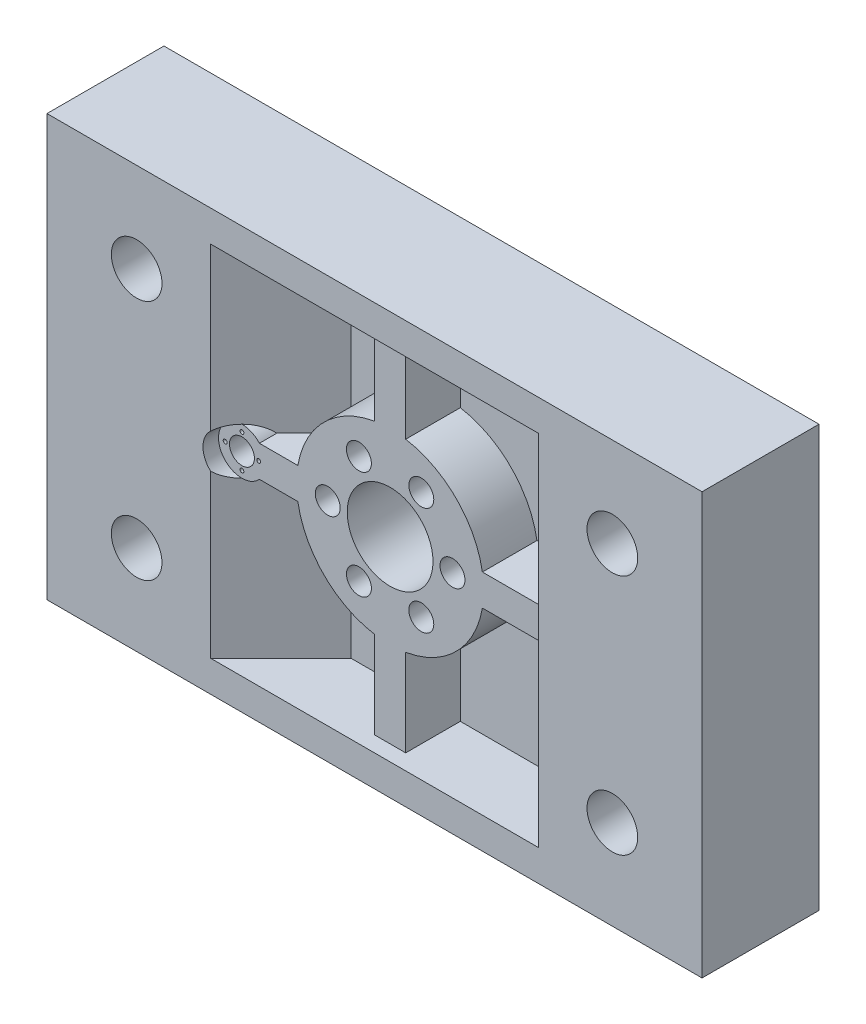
from build123d import *

# Parameters (mm, degrees)
SKETCH_1_W          = 840
SKETCH_1_H          = 540
SKETCH_1_R          = 55
SKETCH_1_R_2        = 16
SKETCH_1_R_3        = 2.5
SKETCH_1_R_4        = 11
SKETCH_1_R_5        = 32.5
EXTRUDE_1_DEPTH     = 150
SKETCH_2_W          = 155
SKETCH_2_H          = 210
CUT_EXTRUDE_1_DEPTH = 90
CUT_EXTRUDE_2_REACH = 672
CUT_EXTRUDE_3_DEPTH = 210
EXTRUDE_2_REACH     = 523.344
SKETCH_6_W          = 240
SKETCH_6_H          = 460
CUT_EXTRUDE_4_DEPTH = 90
CUT_EXTRUDE_5_REACH = 672
CUT_EXTRUDE_START   = -20
SKETCH_8_R          = 30
CUT_EXTRUDE_6_DEPTH = 20
EXTRUDE_3_REACH     = 517.946
SKETCH_9_R          = 2.5
SKETCH_10_R         = 11
SKETCH_10_R_2       = 55
EXTRUDE_4_DEPTH     = 70
SKETCH_11_R         = 16
CUT_EXTRUDE_7_DEPTH = 25
EXTRUDE_5_REACH     = 517.946


with BuildPart() as part:
    # Sketch 1 → Extrude 1 (new body)
    with BuildSketch(Plane.XY):
        Rectangle(SKETCH_1_W, SKETCH_1_H)
        Circle(SKETCH_1_R, mode=Mode.SUBTRACT)
        with Locations((-190, 0)):
            Circle(SKETCH_1_R_2, mode=Mode.SUBTRACT)
        with Locations((-211.5, 0)):
            Circle(SKETCH_1_R_3, mode=Mode.SUBTRACT)
        with Locations((-190, -21.5)):
            Circle(SKETCH_1_R_3, mode=Mode.SUBTRACT)
        with Locations(Location((-190, 21.5, 0), (0, 0, 180))):
            Circle(SKETCH_1_R_3, mode=Mode.SUBTRACT)
        with Locations(Location((-168.5, 0, 0), (0, 0, 180))):
            Circle(SKETCH_1_R_3, mode=Mode.SUBTRACT)
        with Locations((80, 0)):
            Circle(SKETCH_1_R_4, mode=Mode.SUBTRACT)
        with Locations((40, -69.282032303)):
            Circle(SKETCH_1_R_4, mode=Mode.SUBTRACT)
        with Locations((-40, -69.282032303)):
            Circle(SKETCH_1_R_4, mode=Mode.SUBTRACT)
        with Locations((-80, 0)):
            Circle(SKETCH_1_R_4, mode=Mode.SUBTRACT)
        with Locations((-40, 69.282032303)):
            Circle(SKETCH_1_R_4, mode=Mode.SUBTRACT)
        with Locations((40, 69.282032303)):
            Circle(SKETCH_1_R_4, mode=Mode.SUBTRACT)
        with Locations((305, -155)):
            Circle(SKETCH_1_R_5, mode=Mode.SUBTRACT)
        with Locations(Location((305, 155, 0), (0, 0, 180))):
            Circle(SKETCH_1_R_5, mode=Mode.SUBTRACT)
        with Locations(Location((-305, -155, 0), (0, 0, 180))):
            Circle(SKETCH_1_R_5, mode=Mode.SUBTRACT)
        with Locations((-305, 155)):
            Circle(SKETCH_1_R_5, mode=Mode.SUBTRACT)
    extrude(amount=EXTRUDE_1_DEPTH)

    # Sketch 2 → Cut-Extrude 1 (cut)
    with BuildSketch(Plane(origin=(0, 0, 0), x_dir=(-1, 0, 0), z_dir=(0, 0, -1))):
        with Locations((-302.5, -125)):
            Rectangle(SKETCH_2_W, SKETCH_2_H)
        with Locations((302.5, -125)):
            Rectangle(SKETCH_2_W, SKETCH_2_H)
        with Locations((302.5, 125)):
            Rectangle(SKETCH_2_W, SKETCH_2_H)
        with Locations((-302.5, 125)):
            Rectangle(SKETCH_2_W, SKETCH_2_H)
    extrude(amount=-CUT_EXTRUDE_1_DEPTH, mode=Mode.SUBTRACT)

    # Cut-Extrude 2: up to this face of the body (flat: up to its plane)
    cut_extrude_2_end = Plane(part.part.faces().sort_by_distance((302.5, 20, 45))[0])
    # Sketch 3 → Cut-Extrude 2 (cut, up to the picked face)
    with BuildSketch(Plane.XZ.offset(-230), mode=Mode.PRIVATE) as cut_extrude_2_sk1:
        Polygon((-225, 0), (-135, 0), (-225, 90), align=None)
    cut_extrude_2_tool1 = split(extrude(cut_extrude_2_sk1.sketch, amount=CUT_EXTRUDE_2_REACH, mode=Mode.PRIVATE), bisect_by=cut_extrude_2_end, keep=Keep.BOTH, mode=Mode.PRIVATE)
    # Sketch 3 → Cut-Extrude 2 (cut, up to the picked face)
    with BuildSketch(Plane.XZ.offset(-230), mode=Mode.PRIVATE) as cut_extrude_2_sk2:
        Polygon((225, 90), (225, 0), (135, 0), align=None)
    cut_extrude_2_tool2 = split(extrude(cut_extrude_2_sk2.sketch, amount=CUT_EXTRUDE_2_REACH, mode=Mode.PRIVATE), bisect_by=cut_extrude_2_end, keep=Keep.BOTH, mode=Mode.PRIVATE)
    add(cut_extrude_2_tool1.solids().sort_by(Axis((-195, 230, 30), (0, -1, 0)))[0], mode=Mode.SUBTRACT)
    add(cut_extrude_2_tool2.solids().sort_by(Axis((195, 230, 30), (0, -1, 0)))[0], mode=Mode.SUBTRACT)

    # Sketch 4 → Cut-Extrude 3 (cut)
    with BuildSketch(Plane(origin=(0, -230, 0), x_dir=(1, 0, 0), z_dir=(0, 1, 0))):
        Polygon((-135, 0), (-225, -90), (-225, 0), align=None)
        Polygon((135, 0), (225, 0), (225, -90), align=None)
    extrude(amount=CUT_EXTRUDE_3_DEPTH, mode=Mode.SUBTRACT)

    # Extrude 2: up to this plane
    extrude_2_end = Plane(origin=(-225, -107.279220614, 90), z_dir=(-0.7071067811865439, 0, -0.7071067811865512))
    # Sketch 5 → Extrude 2 (add, up to the surface)
    with BuildSketch(Plane(origin=(0, 0, 0), x_dir=(-1, 0, 0), z_dir=(0, 0, -1)), mode=Mode.PRIVATE) as extrude_2_sk1:
        with BuildLine():
            ThreePointArc((167.639320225, -20), (190, -30), (212.360679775, -20))
            Line((212.360679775, -20), (192, -20))
            ThreePointArc((192, -20), (192.371708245, -20.709430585), (192.5, -21.5))
            ThreePointArc((192.5, -21.5), (189.209430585, -23.871708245), (188, -20))
            Line((188, -20), (167.639320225, -20))
        make_face()
    extrude_2_tool1 = split(extrude(extrude_2_sk1.sketch, amount=-EXTRUDE_2_REACH, mode=Mode.PRIVATE), bisect_by=extrude_2_end, keep=Keep.BOTH, mode=Mode.PRIVATE)
    add(extrude_2_tool1.solids().sort_by_distance((-190, -24.192442, 0))[0])
    # Sketch 5 → Extrude 2 (add, up to the surface)
    with BuildSketch(Plane(origin=(0, 0, 0), x_dir=(-1, 0, 0), z_dir=(0, 0, -1)), mode=Mode.PRIVATE) as extrude_2_sk2:
        with BuildLine():
            Line((167.639320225, 20), (188, 20))
            ThreePointArc((188, 20), (189.209430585, 23.871708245), (192.5, 21.5))
            ThreePointArc((192.5, 21.5), (192.371708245, 20.709430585), (192, 20))
            Line((192, 20), (212.360679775, 20))
            ThreePointArc((212.360679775, 20), (190, 30), (167.639320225, 20))
        make_face()
    extrude_2_tool2 = split(extrude(extrude_2_sk2.sketch, amount=-EXTRUDE_2_REACH, mode=Mode.PRIVATE), bisect_by=extrude_2_end, keep=Keep.BOTH, mode=Mode.PRIVATE)
    add(extrude_2_tool2.solids().sort_by_distance((-190, 24.192442, 0))[0])

    # Sketch 6 → Cut-Extrude 4 (cut)
    with BuildSketch(Plane.XY.offset(150)):
        Rectangle(SKETCH_6_W, SKETCH_6_H)
    extrude(amount=-CUT_EXTRUDE_4_DEPTH, mode=Mode.SUBTRACT)

    # Cut-Extrude 5: up to this face of the body (flat: up to its plane)
    cut_extrude_5_end = Plane(part.part.faces().sort_by_distance((0, -230, 105))[0])
    # Sketch 7 → Cut-Extrude 5 (cut, up to the picked face)
    with BuildSketch(Plane.XZ.offset(-230), mode=Mode.PRIVATE) as cut_extrude_5_sk1:
        Polygon((120, 60), (120, 150), (210, 150), align=None)
    cut_extrude_5_tool1 = split(extrude(cut_extrude_5_sk1.sketch, amount=CUT_EXTRUDE_5_REACH, mode=Mode.PRIVATE), bisect_by=cut_extrude_5_end, keep=Keep.BOTH, mode=Mode.PRIVATE)
    # Sketch 7 → Cut-Extrude 5 (cut, up to the picked face)
    with BuildSketch(Plane.XZ.offset(-230), mode=Mode.PRIVATE) as cut_extrude_5_sk2:
        Polygon((-120, 60), (-120, 150), (-210, 150), align=None)
    cut_extrude_5_tool2 = split(extrude(cut_extrude_5_sk2.sketch, amount=CUT_EXTRUDE_5_REACH, mode=Mode.PRIVATE), bisect_by=cut_extrude_5_end, keep=Keep.BOTH, mode=Mode.PRIVATE)
    add(cut_extrude_5_tool1.solids().sort_by(Axis((150, 230, 120), (0, -1, 0)))[0], mode=Mode.SUBTRACT)
    add(cut_extrude_5_tool2.solids().sort_by(Axis((-150, 230, 120), (0, -1, 0)))[0], mode=Mode.SUBTRACT)

    # Sketch 8 → Cut-Extrude 6 (cut)
    with BuildSketch(Plane.XY.offset(150).offset(CUT_EXTRUDE_START)):
        with Locations((-190, 0)):
            Circle(SKETCH_8_R)
    extrude(amount=CUT_EXTRUDE_6_DEPTH, mode=Mode.SUBTRACT)

    # Sketch 9 → Extrude 3 (add, up to next)
    with BuildSketch(Plane.XY.offset(130), mode=Mode.PRIVATE) as extrude_3_sk1:
        with BuildLine():
            Line((-190, 19), (-190, 16))
            ThreePointArc((-190, 16), (-174, 0), (-190, -16))
            Line((-190, -16), (-190, -19))
            ThreePointArc((-190, -19), (-187.5, -21.5), (-190, -24))
            Line((-190, -24), (-190, -30))
            ThreePointArc((-190, -30), (-160, 0), (-190, 30))
            Line((-190, 30), (-190, 24))
            ThreePointArc((-190, 24), (-187.5, 21.5), (-190, 19))
        make_face()
        with Locations(Location((-168.5, 0, 0), (0, 0, 180))):
            Circle(SKETCH_9_R, mode=Mode.SUBTRACT)
    extrude_3_tool1 = extrude(extrude_3_sk1.sketch, amount=-EXTRUDE_3_REACH, mode=Mode.PRIVATE) - part.part
    add(extrude_3_tool1.solids().sort_by_distance((-189.32918, -17.5, 130))[0])

    # Sketch 10 → Extrude 4 (add)
    with BuildSketch(Plane.XY.offset(60)):
        with BuildLine():
            Line((-20, -118.321595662), (-20, -230))
            Line((-20, -230), (20, -230))
            Line((20, -230), (20, -118.321595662))
            ThreePointArc((20, -118.321595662), (120, 0), (20, 118.321595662))
            Line((20, 118.321595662), (20, 230))
            Line((20, 230), (-20, 230))
            Line((-20, 230), (-20, 118.321595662))
            ThreePointArc((-20, 118.321595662), (-120, 0), (-20, -118.321595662))
        make_face()
        with Locations((80, 0)):
            Circle(SKETCH_10_R, mode=Mode.SUBTRACT)
        with Locations((40, -69.282032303)):
            Circle(SKETCH_10_R, mode=Mode.SUBTRACT)
        with Locations((-40, -69.282032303)):
            Circle(SKETCH_10_R, mode=Mode.SUBTRACT)
        with Locations((-80, 0)):
            Circle(SKETCH_10_R, mode=Mode.SUBTRACT)
        with Locations((40, 69.282032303)):
            Circle(SKETCH_10_R, mode=Mode.SUBTRACT)
        with Locations((-40, 69.282032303)):
            Circle(SKETCH_10_R, mode=Mode.SUBTRACT)
        Circle(SKETCH_10_R_2, mode=Mode.SUBTRACT)
    extrude(amount=EXTRUDE_4_DEPTH)

    # Sketch 11 → Cut-Extrude 7 (cut)
    with BuildSketch(Plane.XY.offset(130)):
        with Locations((-40, 69.282032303)):
            Circle(SKETCH_11_R)
        with Locations((40, 69.282032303)):
            Circle(SKETCH_11_R)
        with Locations((80, 0)):
            Circle(SKETCH_11_R)
        with Locations((-80, 0)):
            Circle(SKETCH_11_R)
        with Locations((-40, -69.282032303)):
            Circle(SKETCH_11_R)
        with Locations((40, -69.282032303)):
            Circle(SKETCH_11_R)
    extrude(amount=-CUT_EXTRUDE_7_DEPTH, mode=Mode.SUBTRACT)

    # Sketch 12 → Extrude 5 (add, up to next)
    with BuildSketch(Plane.XY.offset(130), mode=Mode.PRIVATE) as extrude_5_sk1:
        with BuildLine():
            Line((-167.639320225, -20), (-118.321595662, -20))
            ThreePointArc((-118.321595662, -20), (-120, 0), (-118.321595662, 20))
            Line((-118.321595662, 20), (-167.639320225, 20))
            ThreePointArc((-167.639320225, 20), (-160, 0), (-167.639320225, -20))
        make_face()
    extrude_5_tool1 = extrude(extrude_5_sk1.sketch, amount=-EXTRUDE_5_REACH, mode=Mode.PRIVATE) - part.part
    # Sketch 12 → Extrude 5 (add, up to next)
    with BuildSketch(Plane.XY.offset(130), mode=Mode.PRIVATE) as extrude_5_sk2:
        with BuildLine():
            Line((210, -20), (210, 20))
            Line((210, 20), (118.321595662, 20))
            ThreePointArc((118.321595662, 20), (120, 0), (118.321595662, -20))
            Line((118.321595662, -20), (210, -20))
        make_face()
    extrude_5_tool2 = extrude(extrude_5_sk2.sketch, amount=-EXTRUDE_5_REACH, mode=Mode.PRIVATE) - part.part
    add(extrude_5_tool1.solids().sort_by_distance((-140.976154, 0, 130))[0])
    add(extrude_5_tool2.solids().sort_by_distance((164.719673, 0, 130))[0])


solid = part.part
